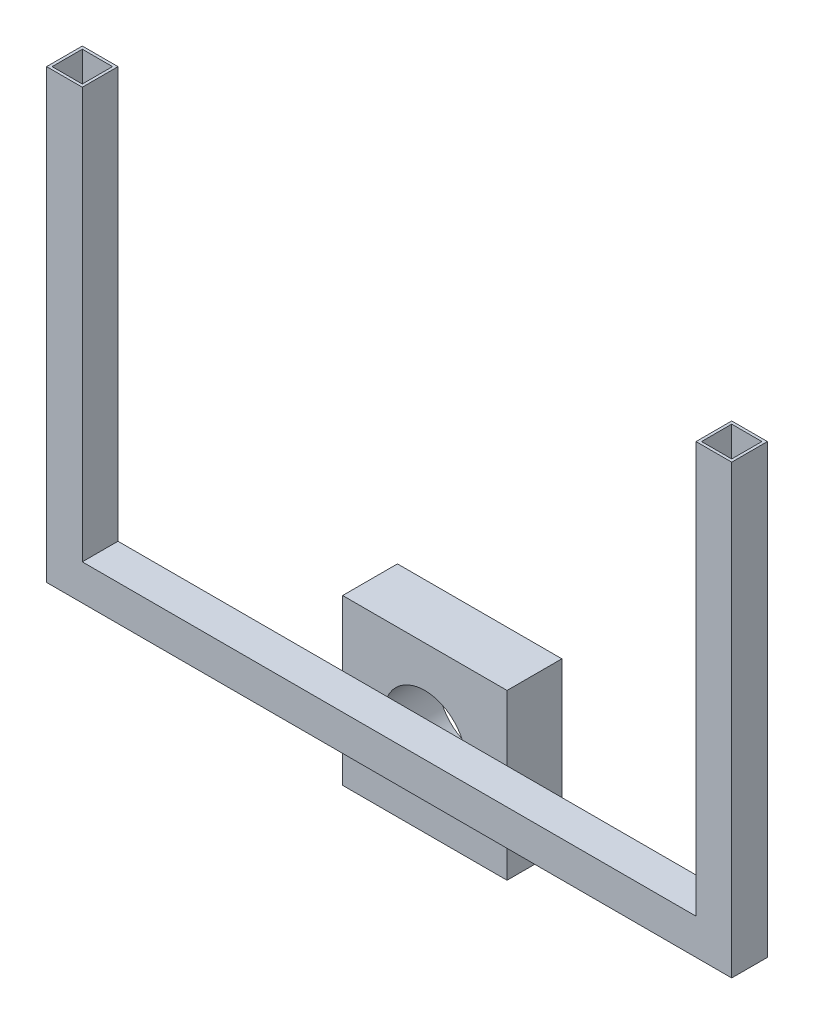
ISO-10303-21;
HEADER;
FILE_DESCRIPTION(('STEP AP214'),'2;1');
FILE_NAME('part.step','',(''),(''),'','','');
FILE_SCHEMA(('AUTOMOTIVE_DESIGN { 1 0 10303 214 1 1 1 1 }'));
ENDSEC;
DATA;
#1=APPLICATION_CONTEXT('core data for automotive mechanical design processes');
#2=APPLICATION_PROTOCOL_DEFINITION('international standard','automotive_design',2000,#1);
#3=PRODUCT_CONTEXT('',#1,'mechanical');
#4=PRODUCT('Part','Part','',(#3));
#5=PRODUCT_RELATED_PRODUCT_CATEGORY('part','',(#4));
#6=PRODUCT_DEFINITION_FORMATION('','',#4);
#7=PRODUCT_DEFINITION_CONTEXT('part definition',#1,'design');
#8=PRODUCT_DEFINITION('design','',#6,#7);
#9=PRODUCT_DEFINITION_SHAPE('','',#8);
#10=(LENGTH_UNIT() NAMED_UNIT(*) SI_UNIT(.MILLI.,.METRE.));
#11=(NAMED_UNIT(*) PLANE_ANGLE_UNIT() SI_UNIT($,.RADIAN.));
#12=(NAMED_UNIT(*) SI_UNIT($,.STERADIAN.) SOLID_ANGLE_UNIT());
#13=UNCERTAINTY_MEASURE_WITH_UNIT(LENGTH_MEASURE(1.E-05),#10,'distance_accuracy_value','');
#14=(GEOMETRIC_REPRESENTATION_CONTEXT(3) GLOBAL_UNCERTAINTY_ASSIGNED_CONTEXT((#13)) GLOBAL_UNIT_ASSIGNED_CONTEXT((#10,
#11,#12)) REPRESENTATION_CONTEXT('',''));
#15=CARTESIAN_POINT('',(0.,0.,0.));
#16=DIRECTION('',(0.,0.,1.));
#17=DIRECTION('',(1.,0.,0.));
#18=AXIS2_PLACEMENT_3D('',#15,#16,#17);
#19=CARTESIAN_POINT('',(0.,13.022,-13.022));
#20=DIRECTION('',(0.,0.,1.));
#21=DIRECTION('',(1.,0.,0.));
#22=AXIS2_PLACEMENT_3D('',#19,#20,#21);
#23=PLANE('',#22);
#24=DIRECTION('',(0.,1.,0.));
#25=VECTOR('',#24,1.);
#26=CARTESIAN_POINT('',(95.,-23.1312189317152,-13.022));
#27=LINE('',#26,#25);
#28=CARTESIAN_POINT('',(95.,0.,-13.022));
#29=VERTEX_POINT('',#28);
#30=CARTESIAN_POINT('',(95.,13.022,-13.022));
#31=VERTEX_POINT('',#30);
#32=EDGE_CURVE('E50',#29,#31,#27,.T.);
#33=ORIENTED_EDGE('',*,*,#32,.F.);
#34=DIRECTION('',(-1.,0.,0.));
#35=VECTOR('',#34,1.);
#36=CARTESIAN_POINT('',(0.,0.,-13.022));
#37=LINE('',#36,#35);
#38=CARTESIAN_POINT('',(0.,0.,-13.022));
#39=VERTEX_POINT('',#38);
#40=EDGE_CURVE('E424',#29,#39,#37,.T.);
#41=ORIENTED_EDGE('',*,*,#40,.T.);
#42=DIRECTION('',(0.,-1.,0.));
#43=VECTOR('',#42,1.);
#44=CARTESIAN_POINT('',(0.,13.022,-13.022));
#45=LINE('',#44,#43);
#46=CARTESIAN_POINT('',(0.,163.022,-13.022));
#47=VERTEX_POINT('',#46);
#48=EDGE_CURVE('E412',#47,#39,#45,.T.);
#49=ORIENTED_EDGE('',*,*,#48,.F.);
#50=DIRECTION('',(-1.,0.,0.));
#51=VECTOR('',#50,1.);
#52=CARTESIAN_POINT('',(0.,163.022,-13.022));
#53=LINE('',#52,#51);
#54=CARTESIAN_POINT('',(13.022,163.022,-13.022));
#55=VERTEX_POINT('',#54);
#56=EDGE_CURVE('E387',#55,#47,#53,.T.);
#57=ORIENTED_EDGE('',*,*,#56,.F.);
#58=DIRECTION('',(0.,-1.,0.));
#59=VECTOR('',#58,1.);
#60=CARTESIAN_POINT('',(13.022,163.022,-13.022));
#61=LINE('',#60,#59);
#62=CARTESIAN_POINT('',(13.022,13.022,-13.022));
#63=VERTEX_POINT('',#62);
#64=EDGE_CURVE('E391',#55,#63,#61,.T.);
#65=ORIENTED_EDGE('',*,*,#64,.T.);
#66=DIRECTION('',(-1.,0.,0.));
#67=VECTOR('',#66,1.);
#68=CARTESIAN_POINT('',(0.,13.022,-13.022));
#69=LINE('',#68,#67);
#70=EDGE_CURVE('E406',#31,#63,#69,.T.);
#71=ORIENTED_EDGE('',*,*,#70,.F.);
#72=EDGE_LOOP('',(#33,#41,#49,#57,#65,#71));
#73=FACE_BOUND('',#72,.T.);
#74=ADVANCED_FACE('F41',(#73),#23,.F.);
#75=DIRECTION('',(0.,-1.,0.));
#76=VECTOR('',#75,1.);
#77=CARTESIAN_POINT('',(155.,-23.1312189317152,-13.022));
#78=LINE('',#77,#76);
#79=CARTESIAN_POINT('',(155.,13.022,-13.022));
#80=VERTEX_POINT('',#79);
#81=CARTESIAN_POINT('',(155.,0.,-13.022));
#82=VERTEX_POINT('',#81);
#83=EDGE_CURVE('E332',#80,#82,#78,.T.);
#84=ORIENTED_EDGE('',*,*,#83,.F.);
#85=CARTESIAN_POINT('',(236.978,13.022,-13.022));
#86=VERTEX_POINT('',#85);
#87=EDGE_CURVE('E408',#86,#80,#69,.T.);
#88=ORIENTED_EDGE('',*,*,#87,.F.);
#89=DIRECTION('',(0.,-1.,0.));
#90=VECTOR('',#89,1.);
#91=CARTESIAN_POINT('',(236.978,163.022,-13.022));
#92=LINE('',#91,#90);
#93=CARTESIAN_POINT('',(236.978,163.022,-13.022));
#94=VERTEX_POINT('',#93);
#95=EDGE_CURVE('E372',#94,#86,#92,.T.);
#96=ORIENTED_EDGE('',*,*,#95,.F.);
#97=DIRECTION('',(-1.,0.,0.));
#98=VECTOR('',#97,1.);
#99=CARTESIAN_POINT('',(250.,163.022,-13.022));
#100=LINE('',#99,#98);
#101=CARTESIAN_POINT('',(250.,163.022,-13.022));
#102=VERTEX_POINT('',#101);
#103=EDGE_CURVE('E355',#102,#94,#100,.T.);
#104=ORIENTED_EDGE('',*,*,#103,.F.);
#105=DIRECTION('',(0.,-1.,0.));
#106=VECTOR('',#105,1.);
#107=CARTESIAN_POINT('',(250.,13.022,-13.022));
#108=LINE('',#107,#106);
#109=CARTESIAN_POINT('',(250.,0.,-13.022));
#110=VERTEX_POINT('',#109);
#111=EDGE_CURVE('E432',#102,#110,#108,.T.);
#112=ORIENTED_EDGE('',*,*,#111,.T.);
#113=EDGE_CURVE('E407',#110,#82,#37,.T.);
#114=ORIENTED_EDGE('',*,*,#113,.T.);
#115=EDGE_LOOP('',(#84,#88,#96,#104,#112,#114));
#116=FACE_BOUND('',#115,.T.);
#117=ADVANCED_FACE('F553',(#116),#23,.F.);
#118=CARTESIAN_POINT('',(0.,13.022,0.));
#119=DIRECTION('',(0.,-1.,0.));
#120=DIRECTION('',(0.,0.,-1.));
#121=AXIS2_PLACEMENT_3D('',#118,#119,#120);
#122=PLANE('',#121);
#123=DIRECTION('',(0.,0.,1.));
#124=VECTOR('',#123,1.);
#125=CARTESIAN_POINT('',(236.978,13.022,0.));
#126=LINE('',#125,#124);
#127=CARTESIAN_POINT('',(236.978,13.022,0.));
#128=VERTEX_POINT('',#127);
#129=EDGE_CURVE('E350',#86,#128,#126,.T.);
#130=ORIENTED_EDGE('',*,*,#129,.F.);
#131=ORIENTED_EDGE('',*,*,#87,.T.);
#132=CARTESIAN_POINT('',(138.679835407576,13.022,-13.022));
#133=VERTEX_POINT('',#132);
#134=EDGE_CURVE('E413',#80,#133,#69,.T.);
#135=ORIENTED_EDGE('',*,*,#134,.T.);
#136=CARTESIAN_POINT('',(111.320164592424,13.022,-13.022));
#137=VERTEX_POINT('',#136);
#138=EDGE_CURVE('E486',#133,#137,#69,.T.);
#139=ORIENTED_EDGE('',*,*,#138,.T.);
#140=EDGE_CURVE('E414',#137,#31,#69,.T.);
#141=ORIENTED_EDGE('',*,*,#140,.T.);
#142=ORIENTED_EDGE('',*,*,#70,.T.);
#143=DIRECTION('',(0.,0.,-1.));
#144=VECTOR('',#143,1.);
#145=CARTESIAN_POINT('',(13.022,13.022,0.));
#146=LINE('',#145,#144);
#147=CARTESIAN_POINT('',(13.022,13.022,0.));
#148=VERTEX_POINT('',#147);
#149=EDGE_CURVE('E376',#148,#63,#146,.T.);
#150=ORIENTED_EDGE('',*,*,#149,.F.);
#151=DIRECTION('',(1.,0.,0.));
#152=VECTOR('',#151,1.);
#153=CARTESIAN_POINT('',(0.,13.022,0.));
#154=LINE('',#153,#152);
#155=EDGE_CURVE('E403',#148,#128,#154,.T.);
#156=ORIENTED_EDGE('',*,*,#155,.T.);
#157=EDGE_LOOP('',(#130,#131,#135,#139,#141,#142,#150,#156));
#158=FACE_BOUND('',#157,.T.);
#159=ADVANCED_FACE('F492',(#158),#122,.F.);
#160=CARTESIAN_POINT('',(0.,13.022,0.));
#161=DIRECTION('',(1.,0.,0.));
#162=DIRECTION('',(0.,0.,-1.));
#163=AXIS2_PLACEMENT_3D('',#160,#161,#162);
#164=PLANE('',#163);
#165=DIRECTION('',(0.,0.,1.));
#166=VECTOR('',#165,1.);
#167=CARTESIAN_POINT('',(0.,0.,0.));
#168=LINE('',#167,#166);
#169=CARTESIAN_POINT('',(0.,0.,0.));
#170=VERTEX_POINT('',#169);
#171=EDGE_CURVE('E402',#39,#170,#168,.T.);
#172=ORIENTED_EDGE('',*,*,#171,.T.);
#173=DIRECTION('',(0.,-1.,0.));
#174=VECTOR('',#173,1.);
#175=CARTESIAN_POINT('',(0.,13.022,0.));
#176=LINE('',#175,#174);
#177=CARTESIAN_POINT('',(0.,163.022,0.));
#178=VERTEX_POINT('',#177);
#179=EDGE_CURVE('E439',#178,#170,#176,.T.);
#180=ORIENTED_EDGE('',*,*,#179,.F.);
#181=DIRECTION('',(0.,0.,1.));
#182=VECTOR('',#181,1.);
#183=CARTESIAN_POINT('',(0.,163.022,0.));
#184=LINE('',#183,#182);
#185=EDGE_CURVE('E377',#47,#178,#184,.T.);
#186=ORIENTED_EDGE('',*,*,#185,.F.);
#187=ORIENTED_EDGE('',*,*,#48,.T.);
#188=EDGE_LOOP('',(#172,#180,#186,#187));
#189=FACE_BOUND('',#188,.T.);
#190=ADVANCED_FACE('F43',(#189),#164,.F.);
#191=CARTESIAN_POINT('',(0.,13.022,0.));
#192=DIRECTION('',(0.,0.,-1.));
#193=DIRECTION('',(-1.,0.,0.));
#194=AXIS2_PLACEMENT_3D('',#191,#192,#193);
#195=PLANE('',#194);
#196=DIRECTION('',(1.,0.,0.));
#197=VECTOR('',#196,1.);
#198=CARTESIAN_POINT('',(0.,0.,0.));
#199=LINE('',#198,#197);
#200=CARTESIAN_POINT('',(250.,0.,0.));
#201=VERTEX_POINT('',#200);
#202=EDGE_CURVE('E418',#170,#201,#199,.T.);
#203=ORIENTED_EDGE('',*,*,#202,.T.);
#204=DIRECTION('',(0.,-1.,0.));
#205=VECTOR('',#204,1.);
#206=CARTESIAN_POINT('',(250.,13.022,0.));
#207=LINE('',#206,#205);
#208=CARTESIAN_POINT('',(250.,163.022,0.));
#209=VERTEX_POINT('',#208);
#210=EDGE_CURVE('E436',#209,#201,#207,.T.);
#211=ORIENTED_EDGE('',*,*,#210,.F.);
#212=DIRECTION('',(1.,0.,0.));
#213=VECTOR('',#212,1.);
#214=CARTESIAN_POINT('',(250.,163.022,0.));
#215=LINE('',#214,#213);
#216=CARTESIAN_POINT('',(236.978,163.022,0.));
#217=VERTEX_POINT('',#216);
#218=EDGE_CURVE('E361',#217,#209,#215,.T.);
#219=ORIENTED_EDGE('',*,*,#218,.F.);
#220=DIRECTION('',(0.,-1.,0.));
#221=VECTOR('',#220,1.);
#222=CARTESIAN_POINT('',(236.978,163.022,0.));
#223=LINE('',#222,#221);
#224=EDGE_CURVE('E365',#217,#128,#223,.T.);
#225=ORIENTED_EDGE('',*,*,#224,.T.);
#226=ORIENTED_EDGE('',*,*,#155,.F.);
#227=DIRECTION('',(0.,-1.,0.));
#228=VECTOR('',#227,1.);
#229=CARTESIAN_POINT('',(13.022,163.022,0.));
#230=LINE('',#229,#228);
#231=CARTESIAN_POINT('',(13.022,163.022,0.));
#232=VERTEX_POINT('',#231);
#233=EDGE_CURVE('E398',#232,#148,#230,.T.);
#234=ORIENTED_EDGE('',*,*,#233,.F.);
#235=DIRECTION('',(1.,0.,0.));
#236=VECTOR('',#235,1.);
#237=CARTESIAN_POINT('',(0.,163.022,0.));
#238=LINE('',#237,#236);
#239=EDGE_CURVE('E381',#178,#232,#238,.T.);
#240=ORIENTED_EDGE('',*,*,#239,.F.);
#241=ORIENTED_EDGE('',*,*,#179,.T.);
#242=EDGE_LOOP('',(#203,#211,#219,#225,#226,#234,#240,#241));
#243=FACE_BOUND('',#242,.T.);
#244=ADVANCED_FACE('F522',(#243),#195,.F.);
#245=CARTESIAN_POINT('',(250.,13.022,0.));
#246=DIRECTION('',(-1.,0.,0.));
#247=DIRECTION('',(0.,0.,1.));
#248=AXIS2_PLACEMENT_3D('',#245,#246,#247);
#249=PLANE('',#248);
#250=DIRECTION('',(0.,0.,-1.));
#251=VECTOR('',#250,1.);
#252=CARTESIAN_POINT('',(250.,0.,0.));
#253=LINE('',#252,#251);
#254=EDGE_CURVE('E421',#201,#110,#253,.T.);
#255=ORIENTED_EDGE('',*,*,#254,.T.);
#256=ORIENTED_EDGE('',*,*,#111,.F.);
#257=DIRECTION('',(0.,0.,-1.));
#258=VECTOR('',#257,1.);
#259=CARTESIAN_POINT('',(250.,163.022,0.));
#260=LINE('',#259,#258);
#261=EDGE_CURVE('E351',#209,#102,#260,.T.);
#262=ORIENTED_EDGE('',*,*,#261,.F.);
#263=ORIENTED_EDGE('',*,*,#210,.T.);
#264=EDGE_LOOP('',(#255,#256,#262,#263));
#265=FACE_BOUND('',#264,.T.);
#266=ADVANCED_FACE('F526',(#265),#249,.F.);
#267=CARTESIAN_POINT('',(0.,0.,0.));
#268=DIRECTION('',(0.,-1.,0.));
#269=DIRECTION('',(0.,0.,-1.));
#270=AXIS2_PLACEMENT_3D('',#267,#268,#269);
#271=PLANE('',#270);
#272=ORIENTED_EDGE('',*,*,#171,.F.);
#273=ORIENTED_EDGE('',*,*,#40,.F.);
#274=CARTESIAN_POINT('',(111.665089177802,0.,-13.022));
#275=VERTEX_POINT('',#274);
#276=EDGE_CURVE('E428',#275,#29,#37,.T.);
#277=ORIENTED_EDGE('',*,*,#276,.F.);
#278=CARTESIAN_POINT('',(138.334910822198,0.,-13.022));
#279=VERTEX_POINT('',#278);
#280=EDGE_CURVE('E506',#279,#275,#37,.T.);
#281=ORIENTED_EDGE('',*,*,#280,.F.);
#282=EDGE_CURVE('E427',#82,#279,#37,.T.);
#283=ORIENTED_EDGE('',*,*,#282,.F.);
#284=ORIENTED_EDGE('',*,*,#113,.F.);
#285=ORIENTED_EDGE('',*,*,#254,.F.);
#286=ORIENTED_EDGE('',*,*,#202,.F.);
#287=EDGE_LOOP('',(#272,#273,#277,#281,#283,#284,#285,#286));
#288=FACE_BOUND('',#287,.T.);
#289=ADVANCED_FACE('F513',(#288),#271,.T.);
#290=CARTESIAN_POINT('',(13.022,163.022,0.));
#291=DIRECTION('',(-1.,0.,0.));
#292=DIRECTION('',(0.,0.,1.));
#293=AXIS2_PLACEMENT_3D('',#290,#291,#292);
#294=PLANE('',#293);
#295=ORIENTED_EDGE('',*,*,#149,.T.);
#296=ORIENTED_EDGE('',*,*,#64,.F.);
#297=DIRECTION('',(0.,0.,-1.));
#298=VECTOR('',#297,1.);
#299=CARTESIAN_POINT('',(13.022,163.022,0.));
#300=LINE('',#299,#298);
#301=EDGE_CURVE('E384',#232,#55,#300,.T.);
#302=ORIENTED_EDGE('',*,*,#301,.F.);
#303=ORIENTED_EDGE('',*,*,#233,.T.);
#304=EDGE_LOOP('',(#295,#296,#302,#303));
#305=FACE_BOUND('',#304,.T.);
#306=ADVANCED_FACE('F538',(#305),#294,.F.);
#307=CARTESIAN_POINT('',(0.,163.022,0.));
#308=DIRECTION('',(0.,-1.,0.));
#309=DIRECTION('',(0.,0.,-1.));
#310=AXIS2_PLACEMENT_3D('',#307,#308,#309);
#311=PLANE('',#310);
#312=DIRECTION('',(-1.,0.,0.));
#313=VECTOR('',#312,1.);
#314=CARTESIAN_POINT('',(1.00317121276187,163.022,-12.0188287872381));
#315=LINE('',#314,#313);
#316=CARTESIAN_POINT('',(12.0188287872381,163.022,-12.0188287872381));
#317=VERTEX_POINT('',#316);
#318=CARTESIAN_POINT('',(1.00317121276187,163.022,-12.0188287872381));
#319=VERTEX_POINT('',#318);
#320=EDGE_CURVE('E274',#317,#319,#315,.T.);
#321=ORIENTED_EDGE('',*,*,#320,.F.);
#322=DIRECTION('',(0.,0.,-1.));
#323=VECTOR('',#322,1.);
#324=CARTESIAN_POINT('',(12.0188287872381,163.022,-1.00317121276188));
#325=LINE('',#324,#323);
#326=CARTESIAN_POINT('',(12.0188287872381,163.022,-1.00317121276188));
#327=VERTEX_POINT('',#326);
#328=EDGE_CURVE('E57',#327,#317,#325,.T.);
#329=ORIENTED_EDGE('',*,*,#328,.F.);
#330=DIRECTION('',(1.,0.,0.));
#331=VECTOR('',#330,1.);
#332=CARTESIAN_POINT('',(1.00317121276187,163.022,-1.00317121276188));
#333=LINE('',#332,#331);
#334=CARTESIAN_POINT('',(1.00317121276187,163.022,-1.00317121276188));
#335=VERTEX_POINT('',#334);
#336=EDGE_CURVE('E259',#335,#327,#333,.T.);
#337=ORIENTED_EDGE('',*,*,#336,.F.);
#338=DIRECTION('',(0.,0.,1.));
#339=VECTOR('',#338,1.);
#340=CARTESIAN_POINT('',(1.00317121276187,163.022,-1.00317121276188));
#341=LINE('',#340,#339);
#342=EDGE_CURVE('E278',#319,#335,#341,.T.);
#343=ORIENTED_EDGE('',*,*,#342,.F.);
#344=EDGE_LOOP('',(#321,#329,#337,#343));
#345=FACE_BOUND('',#344,.T.);
#346=ORIENTED_EDGE('',*,*,#185,.T.);
#347=ORIENTED_EDGE('',*,*,#239,.T.);
#348=ORIENTED_EDGE('',*,*,#301,.T.);
#349=ORIENTED_EDGE('',*,*,#56,.T.);
#350=EDGE_LOOP('',(#346,#347,#348,#349));
#351=FACE_BOUND('',#350,.T.);
#352=ADVANCED_FACE('F541',(#345,#351),#311,.F.);
#353=CARTESIAN_POINT('',(236.978,163.022,0.));
#354=DIRECTION('',(1.,0.,0.));
#355=DIRECTION('',(0.,0.,-1.));
#356=AXIS2_PLACEMENT_3D('',#353,#354,#355);
#357=PLANE('',#356);
#358=ORIENTED_EDGE('',*,*,#129,.T.);
#359=ORIENTED_EDGE('',*,*,#224,.F.);
#360=DIRECTION('',(0.,0.,1.));
#361=VECTOR('',#360,1.);
#362=CARTESIAN_POINT('',(236.978,163.022,0.));
#363=LINE('',#362,#361);
#364=EDGE_CURVE('E358',#94,#217,#363,.T.);
#365=ORIENTED_EDGE('',*,*,#364,.F.);
#366=ORIENTED_EDGE('',*,*,#95,.T.);
#367=EDGE_LOOP('',(#358,#359,#365,#366));
#368=FACE_BOUND('',#367,.T.);
#369=ADVANCED_FACE('F536',(#368),#357,.F.);
#370=CARTESIAN_POINT('',(0.,163.022,0.));
#371=DIRECTION('',(0.,1.,0.));
#372=DIRECTION('',(0.,0.,1.));
#373=AXIS2_PLACEMENT_3D('',#370,#371,#372);
#374=PLANE('',#373);
#375=DIRECTION('',(0.,0.,-1.));
#376=VECTOR('',#375,1.);
#377=CARTESIAN_POINT('',(248.996828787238,163.022,-1.00317121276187));
#378=LINE('',#377,#376);
#379=CARTESIAN_POINT('',(248.996828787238,163.022,-1.00317121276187));
#380=VERTEX_POINT('',#379);
#381=CARTESIAN_POINT('',(248.996828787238,163.022,-12.0188287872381));
#382=VERTEX_POINT('',#381);
#383=EDGE_CURVE('E65',#380,#382,#378,.T.);
#384=ORIENTED_EDGE('',*,*,#383,.F.);
#385=DIRECTION('',(1.,0.,0.));
#386=VECTOR('',#385,1.);
#387=CARTESIAN_POINT('',(237.981171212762,163.022,-1.00317121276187));
#388=LINE('',#387,#386);
#389=CARTESIAN_POINT('',(237.981171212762,163.022,-1.00317121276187));
#390=VERTEX_POINT('',#389);
#391=EDGE_CURVE('E225',#390,#380,#388,.T.);
#392=ORIENTED_EDGE('',*,*,#391,.F.);
#393=DIRECTION('',(0.,0.,1.));
#394=VECTOR('',#393,1.);
#395=CARTESIAN_POINT('',(237.981171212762,163.022,-1.00317121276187));
#396=LINE('',#395,#394);
#397=CARTESIAN_POINT('',(237.981171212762,163.022,-12.0188287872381));
#398=VERTEX_POINT('',#397);
#399=EDGE_CURVE('E229',#398,#390,#396,.T.);
#400=ORIENTED_EDGE('',*,*,#399,.F.);
#401=DIRECTION('',(-1.,0.,0.));
#402=VECTOR('',#401,1.);
#403=CARTESIAN_POINT('',(237.981171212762,163.022,-12.0188287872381));
#404=LINE('',#403,#402);
#405=EDGE_CURVE('E238',#382,#398,#404,.T.);
#406=ORIENTED_EDGE('',*,*,#405,.F.);
#407=EDGE_LOOP('',(#384,#392,#400,#406));
#408=FACE_BOUND('',#407,.T.);
#409=ORIENTED_EDGE('',*,*,#261,.T.);
#410=ORIENTED_EDGE('',*,*,#103,.T.);
#411=ORIENTED_EDGE('',*,*,#364,.T.);
#412=ORIENTED_EDGE('',*,*,#218,.T.);
#413=EDGE_LOOP('',(#409,#410,#411,#412));
#414=FACE_BOUND('',#413,.T.);
#415=ADVANCED_FACE('F529',(#408,#414),#374,.T.);
#416=CARTESIAN_POINT('',(0.,0.,-13.022));
#417=DIRECTION('',(0.,0.,1.));
#418=DIRECTION('',(1.,0.,0.));
#419=AXIS2_PLACEMENT_3D('',#416,#417,#418);
#420=PLANE('',#419);
#421=CARTESIAN_POINT('',(125.,6.86878106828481,-13.022));
#422=DIRECTION('',(0.,0.,-1.));
#423=DIRECTION('',(-1.,0.,0.));
#424=AXIS2_PLACEMENT_3D('',#421,#422,#423);
#425=CIRCLE('',#424,15.);
#426=EDGE_CURVE('E295',#137,#133,#425,.T.);
#427=ORIENTED_EDGE('',*,*,#426,.T.);
#428=ORIENTED_EDGE('',*,*,#134,.F.);
#429=CARTESIAN_POINT('',(155.,36.8687810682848,-13.022));
#430=VERTEX_POINT('',#429);
#431=EDGE_CURVE('E328',#430,#80,#78,.T.);
#432=ORIENTED_EDGE('',*,*,#431,.F.);
#433=DIRECTION('',(1.,0.,0.));
#434=VECTOR('',#433,1.);
#435=CARTESIAN_POINT('',(155.,36.8687810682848,-13.022));
#436=LINE('',#435,#434);
#437=CARTESIAN_POINT('',(95.,36.8687810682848,-13.022));
#438=VERTEX_POINT('',#437);
#439=EDGE_CURVE('E324',#438,#430,#436,.T.);
#440=ORIENTED_EDGE('',*,*,#439,.F.);
#441=EDGE_CURVE('E299',#31,#438,#27,.T.);
#442=ORIENTED_EDGE('',*,*,#441,.F.);
#443=ORIENTED_EDGE('',*,*,#140,.F.);
#444=EDGE_LOOP('',(#427,#428,#432,#440,#442,#443));
#445=FACE_BOUND('',#444,.T.);
#446=ADVANCED_FACE('F478',(#445),#420,.T.);
#447=CARTESIAN_POINT('',(95.,-23.1312189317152,-33.022));
#448=DIRECTION('',(1.,0.,0.));
#449=DIRECTION('',(0.,0.,-1.));
#450=AXIS2_PLACEMENT_3D('',#447,#448,#449);
#451=PLANE('',#450);
#452=CARTESIAN_POINT('',(95.,-23.1312189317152,-13.022));
#453=VERTEX_POINT('',#452);
#454=EDGE_CURVE('E320',#453,#29,#27,.T.);
#455=ORIENTED_EDGE('',*,*,#454,.T.);
#456=ORIENTED_EDGE('',*,*,#32,.T.);
#457=ORIENTED_EDGE('',*,*,#441,.T.);
#458=DIRECTION('',(0.,0.,1.));
#459=VECTOR('',#458,1.);
#460=CARTESIAN_POINT('',(95.,36.8687810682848,-33.022));
#461=LINE('',#460,#459);
#462=CARTESIAN_POINT('',(95.,36.8687810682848,-33.022));
#463=VERTEX_POINT('',#462);
#464=EDGE_CURVE('E346',#463,#438,#461,.T.);
#465=ORIENTED_EDGE('',*,*,#464,.F.);
#466=DIRECTION('',(0.,1.,0.));
#467=VECTOR('',#466,1.);
#468=CARTESIAN_POINT('',(95.,-23.1312189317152,-33.022));
#469=LINE('',#468,#467);
#470=CARTESIAN_POINT('',(95.,-23.1312189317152,-33.022));
#471=VERTEX_POINT('',#470);
#472=EDGE_CURVE('E305',#471,#463,#469,.T.);
#473=ORIENTED_EDGE('',*,*,#472,.F.);
#474=DIRECTION('',(0.,0.,1.));
#475=VECTOR('',#474,1.);
#476=CARTESIAN_POINT('',(95.,-23.1312189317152,-33.022));
#477=LINE('',#476,#475);
#478=EDGE_CURVE('E319',#471,#453,#477,.T.);
#479=ORIENTED_EDGE('',*,*,#478,.T.);
#480=EDGE_LOOP('',(#455,#456,#457,#465,#473,#479));
#481=FACE_BOUND('',#480,.T.);
#482=ADVANCED_FACE('F467',(#481),#451,.F.);
#483=CARTESIAN_POINT('',(155.,36.8687810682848,-33.022));
#484=DIRECTION('',(0.,-1.,0.));
#485=DIRECTION('',(0.,0.,-1.));
#486=AXIS2_PLACEMENT_3D('',#483,#484,#485);
#487=PLANE('',#486);
#488=ORIENTED_EDGE('',*,*,#439,.T.);
#489=DIRECTION('',(0.,0.,1.));
#490=VECTOR('',#489,1.);
#491=CARTESIAN_POINT('',(155.,36.8687810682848,-33.022));
#492=LINE('',#491,#490);
#493=CARTESIAN_POINT('',(155.,36.8687810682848,-33.022));
#494=VERTEX_POINT('',#493);
#495=EDGE_CURVE('E342',#494,#430,#492,.T.);
#496=ORIENTED_EDGE('',*,*,#495,.F.);
#497=DIRECTION('',(1.,0.,0.));
#498=VECTOR('',#497,1.);
#499=CARTESIAN_POINT('',(155.,36.8687810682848,-33.022));
#500=LINE('',#499,#498);
#501=EDGE_CURVE('E309',#463,#494,#500,.T.);
#502=ORIENTED_EDGE('',*,*,#501,.F.);
#503=ORIENTED_EDGE('',*,*,#464,.T.);
#504=EDGE_LOOP('',(#488,#496,#502,#503));
#505=FACE_BOUND('',#504,.T.);
#506=ADVANCED_FACE('F592',(#505),#487,.F.);
#507=CARTESIAN_POINT('',(155.,-23.1312189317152,-33.022));
#508=DIRECTION('',(-1.,0.,0.));
#509=DIRECTION('',(0.,0.,1.));
#510=AXIS2_PLACEMENT_3D('',#507,#508,#509);
#511=PLANE('',#510);
#512=ORIENTED_EDGE('',*,*,#431,.T.);
#513=ORIENTED_EDGE('',*,*,#83,.T.);
#514=CARTESIAN_POINT('',(155.,-23.1312189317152,-13.022));
#515=VERTEX_POINT('',#514);
#516=EDGE_CURVE('E327',#82,#515,#78,.T.);
#517=ORIENTED_EDGE('',*,*,#516,.T.);
#518=DIRECTION('',(0.,0.,1.));
#519=VECTOR('',#518,1.);
#520=CARTESIAN_POINT('',(155.,-23.1312189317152,-33.022));
#521=LINE('',#520,#519);
#522=CARTESIAN_POINT('',(155.,-23.1312189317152,-33.022));
#523=VERTEX_POINT('',#522);
#524=EDGE_CURVE('E338',#523,#515,#521,.T.);
#525=ORIENTED_EDGE('',*,*,#524,.F.);
#526=DIRECTION('',(0.,-1.,0.));
#527=VECTOR('',#526,1.);
#528=CARTESIAN_POINT('',(155.,-23.1312189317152,-33.022));
#529=LINE('',#528,#527);
#530=EDGE_CURVE('E313',#494,#523,#529,.T.);
#531=ORIENTED_EDGE('',*,*,#530,.F.);
#532=ORIENTED_EDGE('',*,*,#495,.T.);
#533=EDGE_LOOP('',(#512,#513,#517,#525,#531,#532));
#534=FACE_BOUND('',#533,.T.);
#535=ADVANCED_FACE('F452',(#534),#511,.F.);
#536=CARTESIAN_POINT('',(155.,-23.1312189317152,-33.022));
#537=DIRECTION('',(0.,1.,0.));
#538=DIRECTION('',(0.,0.,1.));
#539=AXIS2_PLACEMENT_3D('',#536,#537,#538);
#540=PLANE('',#539);
#541=DIRECTION('',(-1.,0.,0.));
#542=VECTOR('',#541,1.);
#543=CARTESIAN_POINT('',(155.,-23.1312189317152,-13.022));
#544=LINE('',#543,#542);
#545=EDGE_CURVE('E310',#515,#453,#544,.T.);
#546=ORIENTED_EDGE('',*,*,#545,.T.);
#547=ORIENTED_EDGE('',*,*,#478,.F.);
#548=DIRECTION('',(-1.,0.,0.));
#549=VECTOR('',#548,1.);
#550=CARTESIAN_POINT('',(155.,-23.1312189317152,-33.022));
#551=LINE('',#550,#549);
#552=EDGE_CURVE('E316',#523,#471,#551,.T.);
#553=ORIENTED_EDGE('',*,*,#552,.F.);
#554=ORIENTED_EDGE('',*,*,#524,.T.);
#555=EDGE_LOOP('',(#546,#547,#553,#554));
#556=FACE_BOUND('',#555,.T.);
#557=ADVANCED_FACE('F459',(#556),#540,.F.);
#558=CARTESIAN_POINT('',(0.,0.,-33.022));
#559=DIRECTION('',(0.,0.,1.));
#560=DIRECTION('',(1.,0.,0.));
#561=AXIS2_PLACEMENT_3D('',#558,#559,#560);
#562=PLANE('',#561);
#563=CARTESIAN_POINT('',(125.,6.86878106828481,-33.022));
#564=DIRECTION('',(0.,0.,-1.));
#565=DIRECTION('',(-1.,0.,0.));
#566=AXIS2_PLACEMENT_3D('',#563,#564,#565);
#567=CIRCLE('',#566,15.);
#568=CARTESIAN_POINT('',(110.,6.86878106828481,-33.022));
#569=VERTEX_POINT('',#568);
#570=EDGE_CURVE('E248',#569,#569,#567,.T.);
#571=ORIENTED_EDGE('',*,*,#570,.F.);
#572=EDGE_LOOP('',(#571));
#573=FACE_BOUND('',#572,.T.);
#574=ORIENTED_EDGE('',*,*,#472,.T.);
#575=ORIENTED_EDGE('',*,*,#501,.T.);
#576=ORIENTED_EDGE('',*,*,#530,.T.);
#577=ORIENTED_EDGE('',*,*,#552,.T.);
#578=EDGE_LOOP('',(#574,#575,#576,#577));
#579=FACE_BOUND('',#578,.T.);
#580=ADVANCED_FACE('F471',(#573,#579),#562,.F.);
#581=CARTESIAN_POINT('',(125.,6.86878106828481,-13.022));
#582=DIRECTION('',(0.,0.,1.));
#583=DIRECTION('',(1.,0.,0.));
#584=AXIS2_PLACEMENT_3D('',#581,#582,#583);
#585=CIRCLE('',#584,15.);
#586=EDGE_CURVE('E11',#275,#279,#585,.T.);
#587=ORIENTED_EDGE('',*,*,#586,.F.);
#588=ORIENTED_EDGE('',*,*,#276,.T.);
#589=ORIENTED_EDGE('',*,*,#454,.F.);
#590=ORIENTED_EDGE('',*,*,#545,.F.);
#591=ORIENTED_EDGE('',*,*,#516,.F.);
#592=ORIENTED_EDGE('',*,*,#282,.T.);
#593=EDGE_LOOP('',(#587,#588,#589,#590,#591,#592));
#594=FACE_BOUND('',#593,.T.);
#595=ADVANCED_FACE('F463',(#594),#420,.T.);
#596=CARTESIAN_POINT('',(125.,6.86878106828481,-13.022));
#597=DIRECTION('',(0.,0.,-1.));
#598=DIRECTION('',(-1.,0.,0.));
#599=AXIS2_PLACEMENT_3D('',#596,#597,#598);
#600=PLANE('',#599);
#601=ORIENTED_EDGE('',*,*,#138,.F.);
#602=EDGE_CURVE('E300',#133,#279,#425,.T.);
#603=ORIENTED_EDGE('',*,*,#602,.T.);
#604=ORIENTED_EDGE('',*,*,#280,.T.);
#605=EDGE_CURVE('E301',#275,#137,#425,.T.);
#606=ORIENTED_EDGE('',*,*,#605,.T.);
#607=EDGE_LOOP('',(#601,#603,#604,#606));
#608=FACE_BOUND('',#607,.T.);
#609=ADVANCED_FACE('F504',(#608),#600,.T.);
#610=CARTESIAN_POINT('',(125.,6.86878106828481,-13.022));
#611=DIRECTION('',(0.,0.,-1.));
#612=DIRECTION('',(-1.,0.,0.));
#613=AXIS2_PLACEMENT_3D('',#610,#611,#612);
#614=CYLINDRICAL_SURFACE('',#613,15.);
#615=ORIENTED_EDGE('',*,*,#426,.F.);
#616=ORIENTED_EDGE('',*,*,#605,.F.);
#617=ORIENTED_EDGE('',*,*,#586,.T.);
#618=ORIENTED_EDGE('',*,*,#602,.F.);
#619=EDGE_LOOP('',(#615,#616,#617,#618));
#620=FACE_BOUND('',#619,.T.);
#621=ORIENTED_EDGE('',*,*,#570,.T.);
#622=EDGE_LOOP('',(#621));
#623=FACE_BOUND('',#622,.T.);
#624=ADVANCED_FACE('F508',(#620,#623),#614,.F.);
#625=CARTESIAN_POINT('',(248.996828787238,3.022,-1.00317121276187));
#626=DIRECTION('',(1.,0.,0.));
#627=DIRECTION('',(0.,0.,-1.));
#628=AXIS2_PLACEMENT_3D('',#625,#626,#627);
#629=PLANE('',#628);
#630=ORIENTED_EDGE('',*,*,#383,.T.);
#631=DIRECTION('',(0.,1.,0.));
#632=VECTOR('',#631,1.);
#633=CARTESIAN_POINT('',(248.996828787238,3.022,-12.0188287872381));
#634=LINE('',#633,#632);
#635=CARTESIAN_POINT('',(248.996828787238,3.022,-12.0188287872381));
#636=VERTEX_POINT('',#635);
#637=EDGE_CURVE('E200',#636,#382,#634,.T.);
#638=ORIENTED_EDGE('',*,*,#637,.F.);
#639=DIRECTION('',(0.,0.,-1.));
#640=VECTOR('',#639,1.);
#641=CARTESIAN_POINT('',(248.996828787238,3.022,-1.00317121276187));
#642=LINE('',#641,#640);
#643=CARTESIAN_POINT('',(248.996828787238,3.022,-1.00317121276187));
#644=VERTEX_POINT('',#643);
#645=EDGE_CURVE('E204',#644,#636,#642,.T.);
#646=ORIENTED_EDGE('',*,*,#645,.F.);
#647=DIRECTION('',(0.,1.,0.));
#648=VECTOR('',#647,1.);
#649=CARTESIAN_POINT('',(248.996828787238,3.022,-1.00317121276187));
#650=LINE('',#649,#648);
#651=EDGE_CURVE('E245',#644,#380,#650,.T.);
#652=ORIENTED_EDGE('',*,*,#651,.T.);
#653=EDGE_LOOP('',(#630,#638,#646,#652));
#654=FACE_BOUND('',#653,.T.);
#655=ADVANCED_FACE('F202',(#654),#629,.F.);
#656=CARTESIAN_POINT('',(237.981171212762,3.022,-1.00317121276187));
#657=DIRECTION('',(0.,0.,1.));
#658=DIRECTION('',(1.,0.,0.));
#659=AXIS2_PLACEMENT_3D('',#656,#657,#658);
#660=PLANE('',#659);
#661=ORIENTED_EDGE('',*,*,#391,.T.);
#662=ORIENTED_EDGE('',*,*,#651,.F.);
#663=DIRECTION('',(1.,0.,0.));
#664=VECTOR('',#663,1.);
#665=CARTESIAN_POINT('',(237.981171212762,3.022,-1.00317121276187));
#666=LINE('',#665,#664);
#667=CARTESIAN_POINT('',(237.981171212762,3.022,-1.00317121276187));
#668=VERTEX_POINT('',#667);
#669=EDGE_CURVE('E211',#668,#644,#666,.T.);
#670=ORIENTED_EDGE('',*,*,#669,.F.);
#671=DIRECTION('',(0.,1.,0.));
#672=VECTOR('',#671,1.);
#673=CARTESIAN_POINT('',(237.981171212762,3.022,-1.00317121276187));
#674=LINE('',#673,#672);
#675=EDGE_CURVE('E249',#668,#390,#674,.T.);
#676=ORIENTED_EDGE('',*,*,#675,.T.);
#677=EDGE_LOOP('',(#661,#662,#670,#676));
#678=FACE_BOUND('',#677,.T.);
#679=ADVANCED_FACE('F651',(#678),#660,.F.);
#680=CARTESIAN_POINT('',(237.981171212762,3.022,-1.00317121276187));
#681=DIRECTION('',(-1.,0.,0.));
#682=DIRECTION('',(0.,0.,1.));
#683=AXIS2_PLACEMENT_3D('',#680,#681,#682);
#684=PLANE('',#683);
#685=ORIENTED_EDGE('',*,*,#399,.T.);
#686=ORIENTED_EDGE('',*,*,#675,.F.);
#687=DIRECTION('',(0.,0.,1.));
#688=VECTOR('',#687,1.);
#689=CARTESIAN_POINT('',(237.981171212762,3.022,-1.00317121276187));
#690=LINE('',#689,#688);
#691=CARTESIAN_POINT('',(237.981171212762,3.022,-12.0188287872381));
#692=VERTEX_POINT('',#691);
#693=EDGE_CURVE('E220',#692,#668,#690,.T.);
#694=ORIENTED_EDGE('',*,*,#693,.F.);
#695=DIRECTION('',(0.,1.,0.));
#696=VECTOR('',#695,1.);
#697=CARTESIAN_POINT('',(237.981171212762,3.022,-12.0188287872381));
#698=LINE('',#697,#696);
#699=EDGE_CURVE('E210',#692,#398,#698,.T.);
#700=ORIENTED_EDGE('',*,*,#699,.T.);
#701=EDGE_LOOP('',(#685,#686,#694,#700));
#702=FACE_BOUND('',#701,.T.);
#703=ADVANCED_FACE('F659',(#702),#684,.F.);
#704=CARTESIAN_POINT('',(237.981171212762,3.022,-12.0188287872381));
#705=DIRECTION('',(0.,0.,-1.));
#706=DIRECTION('',(-1.,0.,0.));
#707=AXIS2_PLACEMENT_3D('',#704,#705,#706);
#708=PLANE('',#707);
#709=ORIENTED_EDGE('',*,*,#405,.T.);
#710=ORIENTED_EDGE('',*,*,#699,.F.);
#711=DIRECTION('',(-1.,0.,0.));
#712=VECTOR('',#711,1.);
#713=CARTESIAN_POINT('',(237.981171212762,3.022,-12.0188287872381));
#714=LINE('',#713,#712);
#715=EDGE_CURVE('E214',#636,#692,#714,.T.);
#716=ORIENTED_EDGE('',*,*,#715,.F.);
#717=ORIENTED_EDGE('',*,*,#637,.T.);
#718=EDGE_LOOP('',(#709,#710,#716,#717));
#719=FACE_BOUND('',#718,.T.);
#720=ADVANCED_FACE('F215',(#719),#708,.F.);
#721=CARTESIAN_POINT('',(0.,3.022,0.));
#722=DIRECTION('',(0.,-1.,0.));
#723=DIRECTION('',(0.,0.,-1.));
#724=AXIS2_PLACEMENT_3D('',#721,#722,#723);
#725=PLANE('',#724);
#726=ORIENTED_EDGE('',*,*,#645,.T.);
#727=ORIENTED_EDGE('',*,*,#715,.T.);
#728=ORIENTED_EDGE('',*,*,#693,.T.);
#729=ORIENTED_EDGE('',*,*,#669,.T.);
#730=EDGE_LOOP('',(#726,#727,#728,#729));
#731=FACE_BOUND('',#730,.T.);
#732=ADVANCED_FACE('F222',(#731),#725,.F.);
#733=CARTESIAN_POINT('',(12.0188287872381,3.022,-1.00317121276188));
#734=DIRECTION('',(1.,0.,0.));
#735=DIRECTION('',(0.,0.,-1.));
#736=AXIS2_PLACEMENT_3D('',#733,#734,#735);
#737=PLANE('',#736);
#738=ORIENTED_EDGE('',*,*,#328,.T.);
#739=DIRECTION('',(0.,1.,0.));
#740=VECTOR('',#739,1.);
#741=CARTESIAN_POINT('',(12.0188287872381,3.022,-12.0188287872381));
#742=LINE('',#741,#740);
#743=CARTESIAN_POINT('',(12.0188287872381,3.022,-12.0188287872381));
#744=VERTEX_POINT('',#743);
#745=EDGE_CURVE('E271',#744,#317,#742,.T.);
#746=ORIENTED_EDGE('',*,*,#745,.F.);
#747=DIRECTION('',(0.,0.,-1.));
#748=VECTOR('',#747,1.);
#749=CARTESIAN_POINT('',(12.0188287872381,3.022,-1.00317121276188));
#750=LINE('',#749,#748);
#751=CARTESIAN_POINT('',(12.0188287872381,3.022,-1.00317121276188));
#752=VERTEX_POINT('',#751);
#753=EDGE_CURVE('E254',#752,#744,#750,.T.);
#754=ORIENTED_EDGE('',*,*,#753,.F.);
#755=DIRECTION('',(0.,1.,0.));
#756=VECTOR('',#755,1.);
#757=CARTESIAN_POINT('',(12.0188287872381,3.022,-1.00317121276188));
#758=LINE('',#757,#756);
#759=EDGE_CURVE('E239',#752,#327,#758,.T.);
#760=ORIENTED_EDGE('',*,*,#759,.T.);
#761=EDGE_LOOP('',(#738,#746,#754,#760));
#762=FACE_BOUND('',#761,.T.);
#763=ADVANCED_FACE('F680',(#762),#737,.F.);
#764=CARTESIAN_POINT('',(1.00317121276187,3.022,-1.00317121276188));
#765=DIRECTION('',(0.,0.,1.));
#766=DIRECTION('',(1.,0.,0.));
#767=AXIS2_PLACEMENT_3D('',#764,#765,#766);
#768=PLANE('',#767);
#769=ORIENTED_EDGE('',*,*,#336,.T.);
#770=ORIENTED_EDGE('',*,*,#759,.F.);
#771=DIRECTION('',(1.,0.,0.));
#772=VECTOR('',#771,1.);
#773=CARTESIAN_POINT('',(1.00317121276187,3.022,-1.00317121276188));
#774=LINE('',#773,#772);
#775=CARTESIAN_POINT('',(1.00317121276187,3.022,-1.00317121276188));
#776=VERTEX_POINT('',#775);
#777=EDGE_CURVE('E267',#776,#752,#774,.T.);
#778=ORIENTED_EDGE('',*,*,#777,.F.);
#779=DIRECTION('',(0.,1.,0.));
#780=VECTOR('',#779,1.);
#781=CARTESIAN_POINT('',(1.00317121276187,3.022,-1.00317121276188));
#782=LINE('',#781,#780);
#783=EDGE_CURVE('E287',#776,#335,#782,.T.);
#784=ORIENTED_EDGE('',*,*,#783,.T.);
#785=EDGE_LOOP('',(#769,#770,#778,#784));
#786=FACE_BOUND('',#785,.T.);
#787=ADVANCED_FACE('F687',(#786),#768,.F.);
#788=CARTESIAN_POINT('',(1.00317121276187,3.022,-1.00317121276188));
#789=DIRECTION('',(-1.,0.,0.));
#790=DIRECTION('',(0.,0.,1.));
#791=AXIS2_PLACEMENT_3D('',#788,#789,#790);
#792=PLANE('',#791);
#793=ORIENTED_EDGE('',*,*,#342,.T.);
#794=ORIENTED_EDGE('',*,*,#783,.F.);
#795=DIRECTION('',(0.,0.,1.));
#796=VECTOR('',#795,1.);
#797=CARTESIAN_POINT('',(1.00317121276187,3.022,-1.00317121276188));
#798=LINE('',#797,#796);
#799=CARTESIAN_POINT('',(1.00317121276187,3.022,-12.0188287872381));
#800=VERTEX_POINT('',#799);
#801=EDGE_CURVE('E263',#800,#776,#798,.T.);
#802=ORIENTED_EDGE('',*,*,#801,.F.);
#803=DIRECTION('',(0.,1.,0.));
#804=VECTOR('',#803,1.);
#805=CARTESIAN_POINT('',(1.00317121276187,3.022,-12.0188287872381));
#806=LINE('',#805,#804);
#807=EDGE_CURVE('E290',#800,#319,#806,.T.);
#808=ORIENTED_EDGE('',*,*,#807,.T.);
#809=EDGE_LOOP('',(#793,#794,#802,#808));
#810=FACE_BOUND('',#809,.T.);
#811=ADVANCED_FACE('F694',(#810),#792,.F.);
#812=CARTESIAN_POINT('',(1.00317121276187,3.022,-12.0188287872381));
#813=DIRECTION('',(0.,0.,-1.));
#814=DIRECTION('',(-1.,0.,0.));
#815=AXIS2_PLACEMENT_3D('',#812,#813,#814);
#816=PLANE('',#815);
#817=ORIENTED_EDGE('',*,*,#320,.T.);
#818=ORIENTED_EDGE('',*,*,#807,.F.);
#819=DIRECTION('',(-1.,0.,0.));
#820=VECTOR('',#819,1.);
#821=CARTESIAN_POINT('',(1.00317121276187,3.022,-12.0188287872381));
#822=LINE('',#821,#820);
#823=EDGE_CURVE('E258',#744,#800,#822,.T.);
#824=ORIENTED_EDGE('',*,*,#823,.F.);
#825=ORIENTED_EDGE('',*,*,#745,.T.);
#826=EDGE_LOOP('',(#817,#818,#824,#825));
#827=FACE_BOUND('',#826,.T.);
#828=ADVANCED_FACE('F702',(#827),#816,.F.);
#829=CARTESIAN_POINT('',(0.,3.022,0.));
#830=DIRECTION('',(0.,-1.,0.));
#831=DIRECTION('',(0.,0.,-1.));
#832=AXIS2_PLACEMENT_3D('',#829,#830,#831);
#833=PLANE('',#832);
#834=ORIENTED_EDGE('',*,*,#753,.T.);
#835=ORIENTED_EDGE('',*,*,#823,.T.);
#836=ORIENTED_EDGE('',*,*,#801,.T.);
#837=ORIENTED_EDGE('',*,*,#777,.T.);
#838=EDGE_LOOP('',(#834,#835,#836,#837));
#839=FACE_BOUND('',#838,.T.);
#840=ADVANCED_FACE('F710',(#839),#833,.F.);
#841=CLOSED_SHELL('',(#74,#117,#159,#190,#244,#266,#289,#306,#352,#369,#415,#446,#482,#506,#535,
#557,#580,#595,#609,#624,#655,#679,#703,#720,#732,#763,#787,#811,#828,#840));
#842=MANIFOLD_SOLID_BREP('B2',#841);
#843=ADVANCED_BREP_SHAPE_REPRESENTATION('',(#18,#842),#14);
#844=SHAPE_DEFINITION_REPRESENTATION(#9,#843);
ENDSEC;
END-ISO-10303-21;
